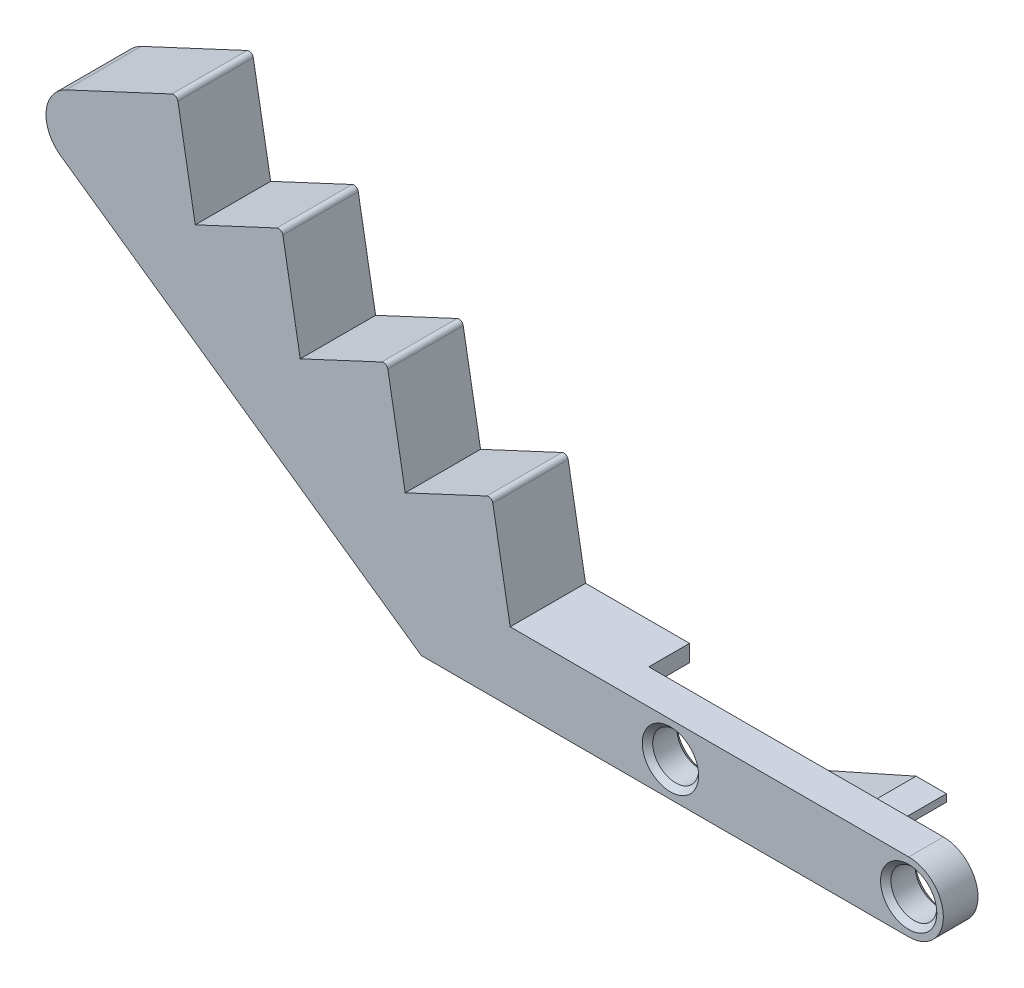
ISO-10303-21;
HEADER;
FILE_DESCRIPTION(('STEP AP214'),'2;1');
FILE_NAME('part.step','',(''),(''),'','','');
FILE_SCHEMA(('AUTOMOTIVE_DESIGN { 1 0 10303 214 1 1 1 1 }'));
ENDSEC;
DATA;
#1=APPLICATION_CONTEXT('core data for automotive mechanical design processes');
#2=APPLICATION_PROTOCOL_DEFINITION('international standard','automotive_design',2000,#1);
#3=PRODUCT_CONTEXT('',#1,'mechanical');
#4=PRODUCT('Part','Part','',(#3));
#5=PRODUCT_RELATED_PRODUCT_CATEGORY('part','',(#4));
#6=PRODUCT_DEFINITION_FORMATION('','',#4);
#7=PRODUCT_DEFINITION_CONTEXT('part definition',#1,'design');
#8=PRODUCT_DEFINITION('design','',#6,#7);
#9=PRODUCT_DEFINITION_SHAPE('','',#8);
#10=(LENGTH_UNIT() NAMED_UNIT(*) SI_UNIT(.MILLI.,.METRE.));
#11=(NAMED_UNIT(*) PLANE_ANGLE_UNIT() SI_UNIT($,.RADIAN.));
#12=(NAMED_UNIT(*) SI_UNIT($,.STERADIAN.) SOLID_ANGLE_UNIT());
#13=UNCERTAINTY_MEASURE_WITH_UNIT(LENGTH_MEASURE(1.E-05),#10,'distance_accuracy_value','');
#14=(GEOMETRIC_REPRESENTATION_CONTEXT(3) GLOBAL_UNCERTAINTY_ASSIGNED_CONTEXT((#13)) GLOBAL_UNIT_ASSIGNED_CONTEXT((#10,
#11,#12)) REPRESENTATION_CONTEXT('',''));
#15=CARTESIAN_POINT('',(0.,0.,0.));
#16=DIRECTION('',(0.,0.,1.));
#17=DIRECTION('',(1.,0.,0.));
#18=AXIS2_PLACEMENT_3D('',#15,#16,#17);
#19=CARTESIAN_POINT('',(-27.5,0.,0.));
#20=DIRECTION('',(0.,0.,1.));
#21=DIRECTION('',(1.,0.,0.));
#22=AXIS2_PLACEMENT_3D('',#19,#20,#21);
#23=PLANE('',#22);
#24=CARTESIAN_POINT('',(0.,0.,0.));
#25=DIRECTION('',(0.,0.,1.));
#26=DIRECTION('',(1.,0.,0.));
#27=AXIS2_PLACEMENT_3D('',#24,#25,#26);
#28=CIRCLE('',#27,3.25);
#29=CARTESIAN_POINT('',(3.25,0.,0.));
#30=VERTEX_POINT('',#29);
#31=EDGE_CURVE('E435',#30,#30,#28,.T.);
#32=ORIENTED_EDGE('',*,*,#31,.T.);
#33=EDGE_LOOP('',(#32));
#34=FACE_BOUND('',#33,.T.);
#35=CARTESIAN_POINT('',(27.5,0.,0.));
#36=DIRECTION('',(0.,0.,1.));
#37=DIRECTION('',(1.,0.,0.));
#38=AXIS2_PLACEMENT_3D('',#35,#36,#37);
#39=CIRCLE('',#38,3.24999999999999);
#40=CARTESIAN_POINT('',(30.75,0.,0.));
#41=VERTEX_POINT('',#40);
#42=EDGE_CURVE('E447',#41,#41,#39,.T.);
#43=ORIENTED_EDGE('',*,*,#42,.T.);
#44=EDGE_LOOP('',(#43));
#45=FACE_BOUND('',#44,.T.);
#46=DIRECTION('',(-1.,0.,0.));
#47=VECTOR('',#46,1.);
#48=CARTESIAN_POINT('',(8.,-3.8,0.));
#49=LINE('',#48,#47);
#50=CARTESIAN_POINT('',(8.,-3.8,0.));
#51=VERTEX_POINT('',#50);
#52=CARTESIAN_POINT('',(6.5,-3.8,0.));
#53=VERTEX_POINT('',#52);
#54=EDGE_CURVE('E392',#51,#53,#49,.T.);
#55=ORIENTED_EDGE('',*,*,#54,.F.);
#56=DIRECTION('',(-0.913545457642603,-0.406736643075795,0.));
#57=VECTOR('',#56,1.);
#58=CARTESIAN_POINT('',(23.160974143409,2.95010058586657,0.));
#59=LINE('',#58,#57);
#60=CARTESIAN_POINT('',(23.1609741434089,2.95010058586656,0.));
#61=VERTEX_POINT('',#60);
#62=EDGE_CURVE('E390',#61,#51,#59,.T.);
#63=ORIENTED_EDGE('',*,*,#62,.F.);
#64=DIRECTION('',(0.,-1.,0.));
#65=VECTOR('',#64,1.);
#66=CARTESIAN_POINT('',(23.160974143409,3.80000000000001,0.));
#67=LINE('',#66,#65);
#68=CARTESIAN_POINT('',(23.1609741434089,3.80000000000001,0.));
#69=VERTEX_POINT('',#68);
#70=EDGE_CURVE('E69',#69,#61,#67,.T.);
#71=ORIENTED_EDGE('',*,*,#70,.F.);
#72=DIRECTION('',(1.,0.,0.));
#73=VECTOR('',#72,1.);
#74=CARTESIAN_POINT('',(19.660974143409,3.80000000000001,0.));
#75=LINE('',#74,#73);
#76=CARTESIAN_POINT('',(19.660974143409,3.80000000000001,0.));
#77=VERTEX_POINT('',#76);
#78=EDGE_CURVE('E371',#77,#69,#75,.T.);
#79=ORIENTED_EDGE('',*,*,#78,.F.);
#80=DIRECTION('',(0.913545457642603,0.406736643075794,0.));
#81=VECTOR('',#80,1.);
#82=CARTESIAN_POINT('',(6.5,-2.0596432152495,0.));
#83=LINE('',#82,#81);
#84=CARTESIAN_POINT('',(6.5,-2.0596432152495,0.));
#85=VERTEX_POINT('',#84);
#86=EDGE_CURVE('E376',#85,#77,#83,.T.);
#87=ORIENTED_EDGE('',*,*,#86,.F.);
#88=DIRECTION('',(0.,1.,0.));
#89=VECTOR('',#88,1.);
#90=CARTESIAN_POINT('',(6.5,-3.8,0.));
#91=LINE('',#90,#89);
#92=EDGE_CURVE('E395',#53,#85,#91,.T.);
#93=ORIENTED_EDGE('',*,*,#92,.F.);
#94=EDGE_LOOP('',(#55,#63,#71,#79,#87,#93));
#95=FACE_BOUND('',#94,.T.);
#96=DIRECTION('',(0.,-1.,0.));
#97=VECTOR('',#96,1.);
#98=CARTESIAN_POINT('',(-6.5,3.8,0.));
#99=LINE('',#98,#97);
#100=CARTESIAN_POINT('',(-6.5,4.,0.));
#101=VERTEX_POINT('',#100);
#102=CARTESIAN_POINT('',(-6.5,2.0596432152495,0.));
#103=VERTEX_POINT('',#102);
#104=EDGE_CURVE('E286',#101,#103,#99,.T.);
#105=ORIENTED_EDGE('',*,*,#104,.F.);
#106=DIRECTION('',(-1.,0.,0.));
#107=VECTOR('',#106,1.);
#108=CARTESIAN_POINT('',(-27.5,4.,0.));
#109=LINE('',#108,#107);
#110=CARTESIAN_POINT('',(27.5,4.00000000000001,0.));
#111=VERTEX_POINT('',#110);
#112=EDGE_CURVE('E419',#111,#101,#109,.T.);
#113=ORIENTED_EDGE('',*,*,#112,.F.);
#114=CARTESIAN_POINT('',(27.5,0.,0.));
#115=DIRECTION('',(0.,0.,1.));
#116=DIRECTION('',(1.,0.,0.));
#117=AXIS2_PLACEMENT_3D('',#114,#115,#116);
#118=CIRCLE('',#117,4.00000000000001);
#119=CARTESIAN_POINT('',(27.5,-4.00000000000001,0.));
#120=VERTEX_POINT('',#119);
#121=EDGE_CURVE('E426',#120,#111,#118,.T.);
#122=ORIENTED_EDGE('',*,*,#121,.F.);
#123=DIRECTION('',(1.,0.,0.));
#124=VECTOR('',#123,1.);
#125=CARTESIAN_POINT('',(-27.5,-4.,0.));
#126=LINE('',#125,#124);
#127=CARTESIAN_POINT('',(-20.1101814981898,-4.,0.));
#128=VERTEX_POINT('',#127);
#129=EDGE_CURVE('E415',#128,#120,#126,.T.);
#130=ORIENTED_EDGE('',*,*,#129,.F.);
#131=DIRECTION('',(-0.913545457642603,-0.406736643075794,0.));
#132=VECTOR('',#131,1.);
#133=CARTESIAN_POINT('',(-6.5,2.0596432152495,0.));
#134=LINE('',#133,#132);
#135=EDGE_CURVE('E61',#103,#128,#134,.T.);
#136=ORIENTED_EDGE('',*,*,#135,.F.);
#137=EDGE_LOOP('',(#105,#113,#122,#130,#136));
#138=FACE_BOUND('',#137,.T.);
#139=ADVANCED_FACE('F45',(#34,#45,#95,#138),#23,.F.);
#140=CARTESIAN_POINT('',(-27.5,4.,4.));
#141=DIRECTION('',(0.,-1.,0.));
#142=DIRECTION('',(1.,0.,0.));
#143=AXIS2_PLACEMENT_3D('',#140,#141,#142);
#144=PLANE('',#143);
#145=ORIENTED_EDGE('',*,*,#112,.T.);
#146=DIRECTION('',(0.,0.,1.));
#147=VECTOR('',#146,1.);
#148=CARTESIAN_POINT('',(-6.5,4.,-82.4586234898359));
#149=LINE('',#148,#147);
#150=CARTESIAN_POINT('',(-6.5,4.,-4.7));
#151=VERTEX_POINT('',#150);
#152=EDGE_CURVE('E346',#151,#101,#149,.T.);
#153=ORIENTED_EDGE('',*,*,#152,.F.);
#154=DIRECTION('',(1.,0.,0.));
#155=VECTOR('',#154,1.);
#156=CARTESIAN_POINT('',(-6.5,4.,-4.7));
#157=LINE('',#156,#155);
#158=CARTESIAN_POINT('',(-18.5,4.00000000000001,-4.7));
#159=VERTEX_POINT('',#158);
#160=EDGE_CURVE('E296',#159,#151,#157,.T.);
#161=ORIENTED_EDGE('',*,*,#160,.F.);
#162=DIRECTION('',(0.,0.,1.));
#163=VECTOR('',#162,1.);
#164=CARTESIAN_POINT('',(-18.5,4.00000000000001,-82.4586234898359));
#165=LINE('',#164,#163);
#166=CARTESIAN_POINT('',(-18.5,4.00000000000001,4.));
#167=VERTEX_POINT('',#166);
#168=EDGE_CURVE('E344',#159,#167,#165,.T.);
#169=ORIENTED_EDGE('',*,*,#168,.T.);
#170=DIRECTION('',(-1.,0.,0.));
#171=VECTOR('',#170,1.);
#172=CARTESIAN_POINT('',(-27.5,4.,4.));
#173=LINE('',#172,#171);
#174=CARTESIAN_POINT('',(27.5,4.00000000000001,4.));
#175=VERTEX_POINT('',#174);
#176=EDGE_CURVE('E421',#175,#167,#173,.T.);
#177=ORIENTED_EDGE('',*,*,#176,.F.);
#178=DIRECTION('',(0.,0.,-1.));
#179=VECTOR('',#178,1.);
#180=CARTESIAN_POINT('',(27.5,4.00000000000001,4.));
#181=LINE('',#180,#179);
#182=EDGE_CURVE('E424',#175,#111,#181,.T.);
#183=ORIENTED_EDGE('',*,*,#182,.T.);
#184=EDGE_LOOP('',(#145,#153,#161,#169,#177,#183));
#185=FACE_BOUND('',#184,.T.);
#186=ADVANCED_FACE('F474',(#185),#144,.F.);
#187=CARTESIAN_POINT('',(-27.5,-4.,4.));
#188=DIRECTION('',(0.,1.,0.));
#189=DIRECTION('',(0.,0.,1.));
#190=AXIS2_PLACEMENT_3D('',#187,#188,#189);
#191=PLANE('',#190);
#192=DIRECTION('',(0.,0.,1.));
#193=VECTOR('',#192,1.);
#194=CARTESIAN_POINT('',(-20.1101814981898,-4.,-82.4586234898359));
#195=LINE('',#194,#193);
#196=CARTESIAN_POINT('',(-20.1101814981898,-4.,-4.7));
#197=VERTEX_POINT('',#196);
#198=EDGE_CURVE('E349',#197,#128,#195,.T.);
#199=ORIENTED_EDGE('',*,*,#198,.T.);
#200=ORIENTED_EDGE('',*,*,#129,.T.);
#201=DIRECTION('',(0.,0.,-1.));
#202=VECTOR('',#201,1.);
#203=CARTESIAN_POINT('',(27.5,-4.00000000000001,4.));
#204=LINE('',#203,#202);
#205=CARTESIAN_POINT('',(27.5,-4.00000000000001,4.));
#206=VERTEX_POINT('',#205);
#207=EDGE_CURVE('E432',#206,#120,#204,.T.);
#208=ORIENTED_EDGE('',*,*,#207,.F.);
#209=DIRECTION('',(1.,0.,0.));
#210=VECTOR('',#209,1.);
#211=CARTESIAN_POINT('',(-27.5,-4.,4.));
#212=LINE('',#211,#210);
#213=CARTESIAN_POINT('',(-28.7611951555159,-4.,4.));
#214=VERTEX_POINT('',#213);
#215=EDGE_CURVE('E416',#214,#206,#212,.T.);
#216=ORIENTED_EDGE('',*,*,#215,.F.);
#217=DIRECTION('',(0.,0.,1.));
#218=VECTOR('',#217,1.);
#219=CARTESIAN_POINT('',(-28.7611951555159,-4.,-82.4586234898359));
#220=LINE('',#219,#218);
#221=CARTESIAN_POINT('',(-28.7611951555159,-4.,-4.7));
#222=VERTEX_POINT('',#221);
#223=EDGE_CURVE('E352',#222,#214,#220,.T.);
#224=ORIENTED_EDGE('',*,*,#223,.F.);
#225=DIRECTION('',(-1.,0.,0.));
#226=VECTOR('',#225,1.);
#227=CARTESIAN_POINT('',(-20.1101814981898,-4.,-4.7));
#228=LINE('',#227,#226);
#229=EDGE_CURVE('E293',#197,#222,#228,.T.);
#230=ORIENTED_EDGE('',*,*,#229,.F.);
#231=EDGE_LOOP('',(#199,#200,#208,#216,#224,#230));
#232=FACE_BOUND('',#231,.T.);
#233=ADVANCED_FACE('F481',(#232),#191,.F.);
#234=CARTESIAN_POINT('',(27.5,0.,4.));
#235=DIRECTION('',(0.,0.,-1.));
#236=DIRECTION('',(-1.,0.,0.));
#237=AXIS2_PLACEMENT_3D('',#234,#235,#236);
#238=CYLINDRICAL_SURFACE('',#237,4.00000000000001);
#239=ORIENTED_EDGE('',*,*,#121,.T.);
#240=ORIENTED_EDGE('',*,*,#182,.F.);
#241=CARTESIAN_POINT('',(27.5,0.,4.));
#242=DIRECTION('',(0.,0.,1.));
#243=DIRECTION('',(1.,0.,0.));
#244=AXIS2_PLACEMENT_3D('',#241,#242,#243);
#245=CIRCLE('',#244,4.00000000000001);
#246=EDGE_CURVE('E418',#206,#175,#245,.T.);
#247=ORIENTED_EDGE('',*,*,#246,.F.);
#248=ORIENTED_EDGE('',*,*,#207,.T.);
#249=EDGE_LOOP('',(#239,#240,#247,#248));
#250=FACE_BOUND('',#249,.T.);
#251=ADVANCED_FACE('F488',(#250),#238,.T.);
#252=CARTESIAN_POINT('',(-27.5,0.,4.));
#253=DIRECTION('',(0.,0.,1.));
#254=DIRECTION('',(1.,0.,0.));
#255=AXIS2_PLACEMENT_3D('',#252,#253,#254);
#256=PLANE('',#255);
#257=CARTESIAN_POINT('',(-68.0793301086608,28.4139528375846,4.));
#258=DIRECTION('',(0.,0.,1.));
#259=DIRECTION('',(1.,0.,0.));
#260=AXIS2_PLACEMENT_3D('',#257,#258,#259);
#261=CIRCLE('',#260,4.);
#262=CARTESIAN_POINT('',(-70.3736358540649,25.1373446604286,4.));
#263=VERTEX_POINT('',#262);
#264=CARTESIAN_POINT('',(-69.7698031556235,32.0391839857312,4.));
#265=VERTEX_POINT('',#264);
#266=EDGE_CURVE('E259',#263,#265,#261,.F.);
#267=ORIENTED_EDGE('',*,*,#266,.F.);
#268=DIRECTION('',(-0.819152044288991,0.573576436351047,0.));
#269=VECTOR('',#268,1.);
#270=CARTESIAN_POINT('',(-28.7611951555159,-4.,4.));
#271=LINE('',#270,#269);
#272=EDGE_CURVE('E262',#214,#263,#271,.T.);
#273=ORIENTED_EDGE('',*,*,#272,.F.);
#274=ORIENTED_EDGE('',*,*,#215,.T.);
#275=ORIENTED_EDGE('',*,*,#246,.T.);
#276=ORIENTED_EDGE('',*,*,#176,.T.);
#277=DIRECTION('',(0.173648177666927,-0.984807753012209,0.));
#278=VECTOR('',#277,1.);
#279=CARTESIAN_POINT('',(-18.5,4.00000000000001,4.));
#280=LINE('',#279,#278);
#281=CARTESIAN_POINT('',(-20.5027724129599,15.3582867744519,4.));
#282=VERTEX_POINT('',#281);
#283=EDGE_CURVE('E264',#282,#167,#280,.T.);
#284=ORIENTED_EDGE('',*,*,#283,.F.);
#285=CARTESIAN_POINT('',(-20.995176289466,15.2714626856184,4.));
#286=DIRECTION('',(0.,0.,1.));
#287=DIRECTION('',(1.,0.,0.));
#288=AXIS2_PLACEMENT_3D('',#285,#286,#287);
#289=CIRCLE('',#288,0.499999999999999);
#290=CARTESIAN_POINT('',(-21.2064854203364,15.7246165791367,4.));
#291=VERTEX_POINT('',#290);
#292=EDGE_CURVE('E267',#291,#282,#289,.F.);
#293=ORIENTED_EDGE('',*,*,#292,.F.);
#294=DIRECTION('',(0.90630778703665,0.4226182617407,0.));
#295=VECTOR('',#294,1.);
#296=CARTESIAN_POINT('',(-21.2064854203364,15.7246165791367,4.));
#297=LINE('',#296,#295);
#298=CARTESIAN_POINT('',(-30.6159237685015,11.33692341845,4.));
#299=VERTEX_POINT('',#298);
#300=EDGE_CURVE('E270',#299,#291,#297,.T.);
#301=ORIENTED_EDGE('',*,*,#300,.F.);
#302=DIRECTION('',(0.173648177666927,-0.984807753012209,0.));
#303=VECTOR('',#302,1.);
#304=CARTESIAN_POINT('',(-30.6159237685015,11.33692341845,4.));
#305=LINE('',#304,#303);
#306=CARTESIAN_POINT('',(-32.6186961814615,22.6952101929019,4.));
#307=VERTEX_POINT('',#306);
#308=EDGE_CURVE('E273',#307,#299,#305,.T.);
#309=ORIENTED_EDGE('',*,*,#308,.F.);
#310=CARTESIAN_POINT('',(-33.1111000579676,22.6083861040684,4.));
#311=DIRECTION('',(0.,0.,1.));
#312=DIRECTION('',(1.,0.,0.));
#313=AXIS2_PLACEMENT_3D('',#310,#311,#312);
#314=CIRCLE('',#313,0.499999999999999);
#315=CARTESIAN_POINT('',(-33.3224091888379,23.0615399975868,4.));
#316=VERTEX_POINT('',#315);
#317=EDGE_CURVE('E276',#316,#307,#314,.F.);
#318=ORIENTED_EDGE('',*,*,#317,.F.);
#319=DIRECTION('',(0.90630778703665,0.422618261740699,0.));
#320=VECTOR('',#319,1.);
#321=CARTESIAN_POINT('',(-33.3224091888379,23.0615399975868,4.));
#322=LINE('',#321,#320);
#323=CARTESIAN_POINT('',(-42.7318475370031,18.6738468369,4.));
#324=VERTEX_POINT('',#323);
#325=EDGE_CURVE('E279',#324,#316,#322,.T.);
#326=ORIENTED_EDGE('',*,*,#325,.F.);
#327=DIRECTION('',(0.173648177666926,-0.984807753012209,0.));
#328=VECTOR('',#327,1.);
#329=CARTESIAN_POINT('',(-42.7318475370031,18.6738468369,4.));
#330=LINE('',#329,#328);
#331=CARTESIAN_POINT('',(-44.734619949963,30.0321336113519,4.));
#332=VERTEX_POINT('',#331);
#333=EDGE_CURVE('E244',#332,#324,#330,.T.);
#334=ORIENTED_EDGE('',*,*,#333,.F.);
#335=CARTESIAN_POINT('',(-45.2270238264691,29.9453095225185,4.));
#336=DIRECTION('',(0.,0.,1.));
#337=DIRECTION('',(1.,0.,0.));
#338=AXIS2_PLACEMENT_3D('',#335,#336,#337);
#339=CIRCLE('',#338,0.499999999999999);
#340=CARTESIAN_POINT('',(-45.4383329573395,30.3984634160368,4.));
#341=VERTEX_POINT('',#340);
#342=EDGE_CURVE('E224',#341,#332,#339,.F.);
#343=ORIENTED_EDGE('',*,*,#342,.F.);
#344=DIRECTION('',(0.90630778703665,0.4226182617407,0.));
#345=VECTOR('',#344,1.);
#346=CARTESIAN_POINT('',(-45.4383329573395,30.3984634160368,4.));
#347=LINE('',#346,#345);
#348=CARTESIAN_POINT('',(-54.8477713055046,26.01077025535,4.));
#349=VERTEX_POINT('',#348);
#350=EDGE_CURVE('E240',#349,#341,#347,.T.);
#351=ORIENTED_EDGE('',*,*,#350,.F.);
#352=DIRECTION('',(0.173648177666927,-0.984807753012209,0.));
#353=VECTOR('',#352,1.);
#354=CARTESIAN_POINT('',(-54.8477713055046,26.01077025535,4.));
#355=LINE('',#354,#353);
#356=CARTESIAN_POINT('',(-56.8505437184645,37.3690570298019,4.));
#357=VERTEX_POINT('',#356);
#358=EDGE_CURVE('E250',#357,#349,#355,.T.);
#359=ORIENTED_EDGE('',*,*,#358,.F.);
#360=CARTESIAN_POINT('',(-57.3429475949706,37.2822329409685,4.));
#361=DIRECTION('',(0.,0.,1.));
#362=DIRECTION('',(1.,0.,0.));
#363=AXIS2_PLACEMENT_3D('',#360,#361,#362);
#364=CIRCLE('',#363,0.500000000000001);
#365=CARTESIAN_POINT('',(-57.554256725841,37.7353868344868,4.));
#366=VERTEX_POINT('',#365);
#367=EDGE_CURVE('E253',#366,#357,#364,.F.);
#368=ORIENTED_EDGE('',*,*,#367,.F.);
#369=DIRECTION('',(0.90630778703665,0.422618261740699,0.));
#370=VECTOR('',#369,1.);
#371=CARTESIAN_POINT('',(-57.554256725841,37.7353868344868,4.));
#372=LINE('',#371,#370);
#373=EDGE_CURVE('E256',#265,#366,#372,.T.);
#374=ORIENTED_EDGE('',*,*,#373,.F.);
#375=EDGE_LOOP('',(#267,#273,#274,#275,#276,#284,#293,#301,#309,#318,#326,#334,#343,#351,#359,
#368,#374));
#376=FACE_BOUND('',#375,.T.);
#377=CARTESIAN_POINT('',(0.,0.,4.));
#378=DIRECTION('',(0.,0.,1.));
#379=DIRECTION('',(1.,0.,0.));
#380=AXIS2_PLACEMENT_3D('',#377,#378,#379);
#381=CIRCLE('',#380,3.24999999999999);
#382=CARTESIAN_POINT('',(3.24999999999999,0.,4.));
#383=VERTEX_POINT('',#382);
#384=EDGE_CURVE('E444',#383,#383,#381,.F.);
#385=ORIENTED_EDGE('',*,*,#384,.T.);
#386=EDGE_LOOP('',(#385));
#387=FACE_BOUND('',#386,.T.);
#388=CARTESIAN_POINT('',(27.5,0.,4.));
#389=DIRECTION('',(0.,0.,1.));
#390=DIRECTION('',(1.,0.,0.));
#391=AXIS2_PLACEMENT_3D('',#388,#389,#390);
#392=CIRCLE('',#391,3.24999999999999);
#393=CARTESIAN_POINT('',(30.75,0.,4.));
#394=VERTEX_POINT('',#393);
#395=EDGE_CURVE('E11',#394,#394,#392,.F.);
#396=ORIENTED_EDGE('',*,*,#395,.T.);
#397=EDGE_LOOP('',(#396));
#398=FACE_BOUND('',#397,.T.);
#399=ADVANCED_FACE('F237',(#376,#387,#398),#256,.T.);
#400=CARTESIAN_POINT('',(27.5,0.,0.));
#401=DIRECTION('',(0.,0.,1.));
#402=DIRECTION('',(1.,0.,0.));
#403=AXIS2_PLACEMENT_3D('',#400,#401,#402);
#404=CYLINDRICAL_SURFACE('',#403,2.65);
#405=CARTESIAN_POINT('',(27.5,0.,3.4));
#406=DIRECTION('',(0.,0.,1.));
#407=DIRECTION('',(1.,0.,0.));
#408=AXIS2_PLACEMENT_3D('',#405,#406,#407);
#409=CIRCLE('',#408,2.65);
#410=CARTESIAN_POINT('',(30.15,0.,3.4));
#411=VERTEX_POINT('',#410);
#412=EDGE_CURVE('E54',#411,#411,#409,.T.);
#413=ORIENTED_EDGE('',*,*,#412,.T.);
#414=EDGE_LOOP('',(#413));
#415=FACE_BOUND('',#414,.T.);
#416=CARTESIAN_POINT('',(27.5,0.,0.599999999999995));
#417=DIRECTION('',(0.,0.,1.));
#418=DIRECTION('',(1.,0.,0.));
#419=AXIS2_PLACEMENT_3D('',#416,#417,#418);
#420=CIRCLE('',#419,2.65);
#421=CARTESIAN_POINT('',(30.15,0.,0.599999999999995));
#422=VERTEX_POINT('',#421);
#423=EDGE_CURVE('E450',#422,#422,#420,.F.);
#424=ORIENTED_EDGE('',*,*,#423,.T.);
#425=EDGE_LOOP('',(#424));
#426=FACE_BOUND('',#425,.T.);
#427=ADVANCED_FACE('F455',(#415,#426),#404,.F.);
#428=CARTESIAN_POINT('',(0.,0.,0.));
#429=DIRECTION('',(0.,0.,1.));
#430=DIRECTION('',(1.,0.,0.));
#431=AXIS2_PLACEMENT_3D('',#428,#429,#430);
#432=CYLINDRICAL_SURFACE('',#431,2.65);
#433=CARTESIAN_POINT('',(0.,0.,3.4));
#434=DIRECTION('',(0.,0.,1.));
#435=DIRECTION('',(1.,0.,0.));
#436=AXIS2_PLACEMENT_3D('',#433,#434,#435);
#437=CIRCLE('',#436,2.65);
#438=CARTESIAN_POINT('',(2.65,0.,3.4));
#439=VERTEX_POINT('',#438);
#440=EDGE_CURVE('E441',#439,#439,#437,.T.);
#441=ORIENTED_EDGE('',*,*,#440,.T.);
#442=EDGE_LOOP('',(#441));
#443=FACE_BOUND('',#442,.T.);
#444=CARTESIAN_POINT('',(0.,0.,0.6));
#445=DIRECTION('',(0.,0.,1.));
#446=DIRECTION('',(1.,0.,0.));
#447=AXIS2_PLACEMENT_3D('',#444,#445,#446);
#448=CIRCLE('',#447,2.65);
#449=CARTESIAN_POINT('',(2.65,0.,0.6));
#450=VERTEX_POINT('',#449);
#451=EDGE_CURVE('E438',#450,#450,#448,.F.);
#452=ORIENTED_EDGE('',*,*,#451,.T.);
#453=EDGE_LOOP('',(#452));
#454=FACE_BOUND('',#453,.T.);
#455=ADVANCED_FACE('F502',(#443,#454),#432,.F.);
#456=CARTESIAN_POINT('',(0.,0.,0.));
#457=DIRECTION('',(0.,0.,-1.));
#458=DIRECTION('',(-1.,0.,0.));
#459=AXIS2_PLACEMENT_3D('',#456,#457,#458);
#460=CONICAL_SURFACE('',#459,3.25,0.785398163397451);
#461=ORIENTED_EDGE('',*,*,#451,.F.);
#462=EDGE_LOOP('',(#461));
#463=FACE_BOUND('',#462,.T.);
#464=ORIENTED_EDGE('',*,*,#31,.F.);
#465=EDGE_LOOP('',(#464));
#466=FACE_BOUND('',#465,.T.);
#467=ADVANCED_FACE('F496',(#463,#466),#460,.F.);
#468=CARTESIAN_POINT('',(0.,0.,3.4));
#469=DIRECTION('',(0.,0.,1.));
#470=DIRECTION('',(1.,0.,0.));
#471=AXIS2_PLACEMENT_3D('',#468,#469,#470);
#472=CONICAL_SURFACE('',#471,2.65,0.785398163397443);
#473=ORIENTED_EDGE('',*,*,#384,.F.);
#474=EDGE_LOOP('',(#473));
#475=FACE_BOUND('',#474,.T.);
#476=ORIENTED_EDGE('',*,*,#440,.F.);
#477=EDGE_LOOP('',(#476));
#478=FACE_BOUND('',#477,.T.);
#479=ADVANCED_FACE('F470',(#475,#478),#472,.F.);
#480=CARTESIAN_POINT('',(27.5,0.,0.));
#481=DIRECTION('',(0.,0.,-1.));
#482=DIRECTION('',(-1.,0.,0.));
#483=AXIS2_PLACEMENT_3D('',#480,#481,#482);
#484=CONICAL_SURFACE('',#483,3.24999999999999,0.785398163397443);
#485=ORIENTED_EDGE('',*,*,#423,.F.);
#486=EDGE_LOOP('',(#485));
#487=FACE_BOUND('',#486,.T.);
#488=ORIENTED_EDGE('',*,*,#42,.F.);
#489=EDGE_LOOP('',(#488));
#490=FACE_BOUND('',#489,.T.);
#491=ADVANCED_FACE('F460',(#487,#490),#484,.F.);
#492=CARTESIAN_POINT('',(27.5,0.,3.4));
#493=DIRECTION('',(0.,0.,1.));
#494=DIRECTION('',(1.,0.,0.));
#495=AXIS2_PLACEMENT_3D('',#492,#493,#494);
#496=CONICAL_SURFACE('',#495,2.65,0.785398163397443);
#497=ORIENTED_EDGE('',*,*,#395,.F.);
#498=EDGE_LOOP('',(#497));
#499=FACE_BOUND('',#498,.T.);
#500=ORIENTED_EDGE('',*,*,#412,.F.);
#501=EDGE_LOOP('',(#500));
#502=FACE_BOUND('',#501,.T.);
#503=ADVANCED_FACE('F48',(#499,#502),#496,.F.);
#504=CARTESIAN_POINT('',(19.660974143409,3.80000000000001,-4.7));
#505=DIRECTION('',(0.,-1.,0.));
#506=DIRECTION('',(1.,0.,0.));
#507=AXIS2_PLACEMENT_3D('',#504,#505,#506);
#508=PLANE('',#507);
#509=ORIENTED_EDGE('',*,*,#78,.T.);
#510=DIRECTION('',(0.,0.,1.));
#511=VECTOR('',#510,1.);
#512=CARTESIAN_POINT('',(23.160974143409,3.80000000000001,-4.7));
#513=LINE('',#512,#511);
#514=CARTESIAN_POINT('',(23.160974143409,3.80000000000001,-4.7));
#515=VERTEX_POINT('',#514);
#516=EDGE_CURVE('E413',#515,#69,#513,.T.);
#517=ORIENTED_EDGE('',*,*,#516,.F.);
#518=DIRECTION('',(1.,0.,0.));
#519=VECTOR('',#518,1.);
#520=CARTESIAN_POINT('',(19.660974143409,3.80000000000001,-4.7));
#521=LINE('',#520,#519);
#522=CARTESIAN_POINT('',(19.660974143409,3.80000000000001,-4.7));
#523=VERTEX_POINT('',#522);
#524=EDGE_CURVE('E372',#523,#515,#521,.T.);
#525=ORIENTED_EDGE('',*,*,#524,.F.);
#526=DIRECTION('',(0.,0.,1.));
#527=VECTOR('',#526,1.);
#528=CARTESIAN_POINT('',(19.660974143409,3.80000000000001,-4.7));
#529=LINE('',#528,#527);
#530=EDGE_CURVE('E386',#523,#77,#529,.T.);
#531=ORIENTED_EDGE('',*,*,#530,.T.);
#532=EDGE_LOOP('',(#509,#517,#525,#531));
#533=FACE_BOUND('',#532,.T.);
#534=ADVANCED_FACE('F459',(#533),#508,.F.);
#535=CARTESIAN_POINT('',(23.160974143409,3.80000000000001,-4.7));
#536=DIRECTION('',(-1.,0.,0.));
#537=DIRECTION('',(0.,0.,1.));
#538=AXIS2_PLACEMENT_3D('',#535,#536,#537);
#539=PLANE('',#538);
#540=ORIENTED_EDGE('',*,*,#70,.T.);
#541=DIRECTION('',(0.,0.,1.));
#542=VECTOR('',#541,1.);
#543=CARTESIAN_POINT('',(23.160974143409,2.95010058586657,-4.7));
#544=LINE('',#543,#542);
#545=CARTESIAN_POINT('',(23.160974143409,2.95010058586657,-4.7));
#546=VERTEX_POINT('',#545);
#547=EDGE_CURVE('E410',#546,#61,#544,.T.);
#548=ORIENTED_EDGE('',*,*,#547,.F.);
#549=DIRECTION('',(0.,-1.,0.));
#550=VECTOR('',#549,1.);
#551=CARTESIAN_POINT('',(23.160974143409,3.80000000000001,-4.7));
#552=LINE('',#551,#550);
#553=EDGE_CURVE('E375',#515,#546,#552,.T.);
#554=ORIENTED_EDGE('',*,*,#553,.F.);
#555=ORIENTED_EDGE('',*,*,#516,.T.);
#556=EDGE_LOOP('',(#540,#548,#554,#555));
#557=FACE_BOUND('',#556,.T.);
#558=ADVANCED_FACE('F466',(#557),#539,.F.);
#559=CARTESIAN_POINT('',(23.160974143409,2.95010058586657,-4.7));
#560=DIRECTION('',(-0.406736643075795,0.913545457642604,0.));
#561=DIRECTION('',(-0.913545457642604,-0.406736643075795,0.));
#562=AXIS2_PLACEMENT_3D('',#559,#560,#561);
#563=PLANE('',#562);
#564=ORIENTED_EDGE('',*,*,#62,.T.);
#565=DIRECTION('',(0.,0.,1.));
#566=VECTOR('',#565,1.);
#567=CARTESIAN_POINT('',(8.,-3.8,-4.7));
#568=LINE('',#567,#566);
#569=CARTESIAN_POINT('',(8.,-3.8,-4.7));
#570=VERTEX_POINT('',#569);
#571=EDGE_CURVE('E407',#570,#51,#568,.T.);
#572=ORIENTED_EDGE('',*,*,#571,.F.);
#573=DIRECTION('',(-0.913545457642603,-0.406736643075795,0.));
#574=VECTOR('',#573,1.);
#575=CARTESIAN_POINT('',(23.160974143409,2.95010058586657,-4.7));
#576=LINE('',#575,#574);
#577=EDGE_CURVE('E378',#546,#570,#576,.T.);
#578=ORIENTED_EDGE('',*,*,#577,.F.);
#579=ORIENTED_EDGE('',*,*,#547,.T.);
#580=EDGE_LOOP('',(#564,#572,#578,#579));
#581=FACE_BOUND('',#580,.T.);
#582=ADVANCED_FACE('F530',(#581),#563,.F.);
#583=CARTESIAN_POINT('',(8.,-3.8,-4.7));
#584=DIRECTION('',(0.,1.,0.));
#585=DIRECTION('',(0.,0.,1.));
#586=AXIS2_PLACEMENT_3D('',#583,#584,#585);
#587=PLANE('',#586);
#588=ORIENTED_EDGE('',*,*,#54,.T.);
#589=DIRECTION('',(0.,0.,1.));
#590=VECTOR('',#589,1.);
#591=CARTESIAN_POINT('',(6.5,-3.8,-4.7));
#592=LINE('',#591,#590);
#593=CARTESIAN_POINT('',(6.5,-3.8,-4.7));
#594=VERTEX_POINT('',#593);
#595=EDGE_CURVE('E404',#594,#53,#592,.T.);
#596=ORIENTED_EDGE('',*,*,#595,.F.);
#597=DIRECTION('',(-1.,0.,0.));
#598=VECTOR('',#597,1.);
#599=CARTESIAN_POINT('',(8.,-3.8,-4.7));
#600=LINE('',#599,#598);
#601=EDGE_CURVE('E380',#570,#594,#600,.T.);
#602=ORIENTED_EDGE('',*,*,#601,.F.);
#603=ORIENTED_EDGE('',*,*,#571,.T.);
#604=EDGE_LOOP('',(#588,#596,#602,#603));
#605=FACE_BOUND('',#604,.T.);
#606=ADVANCED_FACE('F534',(#605),#587,.F.);
#607=CARTESIAN_POINT('',(6.5,-3.8,-4.7));
#608=DIRECTION('',(1.,0.,0.));
#609=DIRECTION('',(0.,0.,-1.));
#610=AXIS2_PLACEMENT_3D('',#607,#608,#609);
#611=PLANE('',#610);
#612=ORIENTED_EDGE('',*,*,#92,.T.);
#613=DIRECTION('',(0.,0.,1.));
#614=VECTOR('',#613,1.);
#615=CARTESIAN_POINT('',(6.5,-2.0596432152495,-4.7));
#616=LINE('',#615,#614);
#617=CARTESIAN_POINT('',(6.5,-2.0596432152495,-4.7));
#618=VERTEX_POINT('',#617);
#619=EDGE_CURVE('E401',#618,#85,#616,.T.);
#620=ORIENTED_EDGE('',*,*,#619,.F.);
#621=DIRECTION('',(0.,1.,0.));
#622=VECTOR('',#621,1.);
#623=CARTESIAN_POINT('',(6.5,-3.8,-4.7));
#624=LINE('',#623,#622);
#625=EDGE_CURVE('E382',#594,#618,#624,.T.);
#626=ORIENTED_EDGE('',*,*,#625,.F.);
#627=ORIENTED_EDGE('',*,*,#595,.T.);
#628=EDGE_LOOP('',(#612,#620,#626,#627));
#629=FACE_BOUND('',#628,.T.);
#630=ADVANCED_FACE('F538',(#629),#611,.F.);
#631=CARTESIAN_POINT('',(6.5,-2.0596432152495,-4.7));
#632=DIRECTION('',(0.406736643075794,-0.913545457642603,0.));
#633=DIRECTION('',(0.913545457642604,0.406736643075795,0.));
#634=AXIS2_PLACEMENT_3D('',#631,#632,#633);
#635=PLANE('',#634);
#636=ORIENTED_EDGE('',*,*,#530,.F.);
#637=DIRECTION('',(0.913545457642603,0.406736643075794,0.));
#638=VECTOR('',#637,1.);
#639=CARTESIAN_POINT('',(6.5,-2.0596432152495,-4.7));
#640=LINE('',#639,#638);
#641=EDGE_CURVE('E384',#618,#523,#640,.T.);
#642=ORIENTED_EDGE('',*,*,#641,.F.);
#643=ORIENTED_EDGE('',*,*,#619,.T.);
#644=ORIENTED_EDGE('',*,*,#86,.T.);
#645=EDGE_LOOP('',(#636,#642,#643,#644));
#646=FACE_BOUND('',#645,.T.);
#647=ADVANCED_FACE('F542',(#646),#635,.F.);
#648=CARTESIAN_POINT('',(0.,0.,-4.7));
#649=DIRECTION('',(0.,0.,-1.));
#650=DIRECTION('',(-1.,0.,0.));
#651=AXIS2_PLACEMENT_3D('',#648,#649,#650);
#652=PLANE('',#651);
#653=ORIENTED_EDGE('',*,*,#577,.T.);
#654=ORIENTED_EDGE('',*,*,#601,.T.);
#655=ORIENTED_EDGE('',*,*,#625,.T.);
#656=ORIENTED_EDGE('',*,*,#641,.T.);
#657=ORIENTED_EDGE('',*,*,#524,.T.);
#658=ORIENTED_EDGE('',*,*,#553,.T.);
#659=EDGE_LOOP('',(#653,#654,#655,#656,#657,#658));
#660=FACE_BOUND('',#659,.T.);
#661=ADVANCED_FACE('F546',(#660),#652,.T.);
#662=CARTESIAN_POINT('',(0.,0.,-4.7));
#663=DIRECTION('',(0.,0.,-1.));
#664=DIRECTION('',(1.,0.,0.));
#665=AXIS2_PLACEMENT_3D('',#662,#663,#664);
#666=PLANE('',#665);
#667=DIRECTION('',(-0.913545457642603,-0.406736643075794,0.));
#668=VECTOR('',#667,1.);
#669=CARTESIAN_POINT('',(-6.5,2.0596432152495,-4.7));
#670=LINE('',#669,#668);
#671=CARTESIAN_POINT('',(-6.5,2.0596432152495,-4.7));
#672=VERTEX_POINT('',#671);
#673=EDGE_CURVE('E364',#672,#197,#670,.T.);
#674=ORIENTED_EDGE('',*,*,#673,.T.);
#675=ORIENTED_EDGE('',*,*,#229,.T.);
#676=DIRECTION('',(-0.819152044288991,0.573576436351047,0.));
#677=VECTOR('',#676,1.);
#678=CARTESIAN_POINT('',(-28.7611951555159,-4.,-4.7));
#679=LINE('',#678,#677);
#680=CARTESIAN_POINT('',(-70.3736358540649,25.1373446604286,-4.7));
#681=VERTEX_POINT('',#680);
#682=EDGE_CURVE('E290',#222,#681,#679,.T.);
#683=ORIENTED_EDGE('',*,*,#682,.T.);
#684=CARTESIAN_POINT('',(-68.0793301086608,28.4139528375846,-4.7));
#685=DIRECTION('',(0.,0.,-1.));
#686=DIRECTION('',(-1.,0.,0.));
#687=AXIS2_PLACEMENT_3D('',#684,#685,#686);
#688=CIRCLE('',#687,4.);
#689=CARTESIAN_POINT('',(-69.7698031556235,32.0391839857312,-4.7));
#690=VERTEX_POINT('',#689);
#691=EDGE_CURVE('E287',#681,#690,#688,.T.);
#692=ORIENTED_EDGE('',*,*,#691,.T.);
#693=DIRECTION('',(0.90630778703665,0.4226182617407,0.));
#694=VECTOR('',#693,1.);
#695=CARTESIAN_POINT('',(-57.554256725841,37.7353868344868,-4.7));
#696=LINE('',#695,#694);
#697=CARTESIAN_POINT('',(-57.554256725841,37.7353868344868,-4.7));
#698=VERTEX_POINT('',#697);
#699=EDGE_CURVE('E283',#690,#698,#696,.T.);
#700=ORIENTED_EDGE('',*,*,#699,.T.);
#701=CARTESIAN_POINT('',(-57.3429475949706,37.2822329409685,-4.7));
#702=DIRECTION('',(0.,0.,-1.));
#703=DIRECTION('',(-1.,0.,0.));
#704=AXIS2_PLACEMENT_3D('',#701,#702,#703);
#705=CIRCLE('',#704,0.500000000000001);
#706=CARTESIAN_POINT('',(-56.8505437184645,37.3690570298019,-4.7));
#707=VERTEX_POINT('',#706);
#708=EDGE_CURVE('E326',#698,#707,#705,.T.);
#709=ORIENTED_EDGE('',*,*,#708,.T.);
#710=DIRECTION('',(0.173648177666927,-0.984807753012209,0.));
#711=VECTOR('',#710,1.);
#712=CARTESIAN_POINT('',(-54.8477713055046,26.01077025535,-4.7));
#713=LINE('',#712,#711);
#714=CARTESIAN_POINT('',(-54.8477713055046,26.01077025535,-4.7));
#715=VERTEX_POINT('',#714);
#716=EDGE_CURVE('E323',#707,#715,#713,.T.);
#717=ORIENTED_EDGE('',*,*,#716,.T.);
#718=DIRECTION('',(0.90630778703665,0.4226182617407,0.));
#719=VECTOR('',#718,1.);
#720=CARTESIAN_POINT('',(-45.4383329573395,30.3984634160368,-4.7));
#721=LINE('',#720,#719);
#722=CARTESIAN_POINT('',(-45.4383329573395,30.3984634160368,-4.7));
#723=VERTEX_POINT('',#722);
#724=EDGE_CURVE('E321',#715,#723,#721,.T.);
#725=ORIENTED_EDGE('',*,*,#724,.T.);
#726=CARTESIAN_POINT('',(-45.2270238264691,29.9453095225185,-4.7));
#727=DIRECTION('',(0.,0.,-1.));
#728=DIRECTION('',(-1.,0.,0.));
#729=AXIS2_PLACEMENT_3D('',#726,#727,#728);
#730=CIRCLE('',#729,0.499999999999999);
#731=CARTESIAN_POINT('',(-44.734619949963,30.0321336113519,-4.7));
#732=VERTEX_POINT('',#731);
#733=EDGE_CURVE('E226',#723,#732,#730,.T.);
#734=ORIENTED_EDGE('',*,*,#733,.T.);
#735=DIRECTION('',(0.173648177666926,-0.984807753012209,0.));
#736=VECTOR('',#735,1.);
#737=CARTESIAN_POINT('',(-42.7318475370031,18.6738468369,-4.7));
#738=LINE('',#737,#736);
#739=CARTESIAN_POINT('',(-42.7318475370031,18.6738468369,-4.7));
#740=VERTEX_POINT('',#739);
#741=EDGE_CURVE('E317',#732,#740,#738,.T.);
#742=ORIENTED_EDGE('',*,*,#741,.T.);
#743=DIRECTION('',(0.90630778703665,0.422618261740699,0.));
#744=VECTOR('',#743,1.);
#745=CARTESIAN_POINT('',(-33.3224091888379,23.0615399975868,-4.7));
#746=LINE('',#745,#744);
#747=CARTESIAN_POINT('',(-33.3224091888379,23.0615399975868,-4.7));
#748=VERTEX_POINT('',#747);
#749=EDGE_CURVE('E314',#740,#748,#746,.T.);
#750=ORIENTED_EDGE('',*,*,#749,.T.);
#751=CARTESIAN_POINT('',(-33.1111000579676,22.6083861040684,-4.7));
#752=DIRECTION('',(0.,0.,-1.));
#753=DIRECTION('',(-1.,0.,0.));
#754=AXIS2_PLACEMENT_3D('',#751,#752,#753);
#755=CIRCLE('',#754,0.499999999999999);
#756=CARTESIAN_POINT('',(-32.6186961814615,22.6952101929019,-4.7));
#757=VERTEX_POINT('',#756);
#758=EDGE_CURVE('E311',#748,#757,#755,.T.);
#759=ORIENTED_EDGE('',*,*,#758,.T.);
#760=DIRECTION('',(0.173648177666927,-0.984807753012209,0.));
#761=VECTOR('',#760,1.);
#762=CARTESIAN_POINT('',(-30.6159237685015,11.33692341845,-4.7));
#763=LINE('',#762,#761);
#764=CARTESIAN_POINT('',(-30.6159237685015,11.33692341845,-4.7));
#765=VERTEX_POINT('',#764);
#766=EDGE_CURVE('E308',#757,#765,#763,.T.);
#767=ORIENTED_EDGE('',*,*,#766,.T.);
#768=DIRECTION('',(0.90630778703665,0.4226182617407,0.));
#769=VECTOR('',#768,1.);
#770=CARTESIAN_POINT('',(-21.2064854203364,15.7246165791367,-4.7));
#771=LINE('',#770,#769);
#772=CARTESIAN_POINT('',(-21.2064854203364,15.7246165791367,-4.7));
#773=VERTEX_POINT('',#772);
#774=EDGE_CURVE('E305',#765,#773,#771,.T.);
#775=ORIENTED_EDGE('',*,*,#774,.T.);
#776=CARTESIAN_POINT('',(-20.995176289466,15.2714626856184,-4.7));
#777=DIRECTION('',(0.,0.,-1.));
#778=DIRECTION('',(-1.,0.,0.));
#779=AXIS2_PLACEMENT_3D('',#776,#777,#778);
#780=CIRCLE('',#779,0.499999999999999);
#781=CARTESIAN_POINT('',(-20.5027724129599,15.3582867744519,-4.7));
#782=VERTEX_POINT('',#781);
#783=EDGE_CURVE('E302',#773,#782,#780,.T.);
#784=ORIENTED_EDGE('',*,*,#783,.T.);
#785=DIRECTION('',(0.173648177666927,-0.984807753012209,0.));
#786=VECTOR('',#785,1.);
#787=CARTESIAN_POINT('',(-18.5,4.00000000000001,-4.7));
#788=LINE('',#787,#786);
#789=EDGE_CURVE('E299',#782,#159,#788,.T.);
#790=ORIENTED_EDGE('',*,*,#789,.T.);
#791=ORIENTED_EDGE('',*,*,#160,.T.);
#792=DIRECTION('',(0.,-1.,0.));
#793=VECTOR('',#792,1.);
#794=CARTESIAN_POINT('',(-6.5,3.8,-4.7));
#795=LINE('',#794,#793);
#796=EDGE_CURVE('E362',#151,#672,#795,.T.);
#797=ORIENTED_EDGE('',*,*,#796,.T.);
#798=EDGE_LOOP('',(#674,#675,#683,#692,#700,#709,#717,#725,#734,#742,#750,#759,#767,#775,#784,
#790,#791,#797));
#799=FACE_BOUND('',#798,.T.);
#800=ADVANCED_FACE('F549',(#799),#666,.T.);
#801=CARTESIAN_POINT('',(-6.5,2.0596432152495,-4.7));
#802=DIRECTION('',(-0.406736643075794,0.913545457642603,0.));
#803=DIRECTION('',(-0.913545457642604,-0.406736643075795,0.));
#804=AXIS2_PLACEMENT_3D('',#801,#802,#803);
#805=PLANE('',#804);
#806=ORIENTED_EDGE('',*,*,#135,.T.);
#807=ORIENTED_EDGE('',*,*,#198,.F.);
#808=ORIENTED_EDGE('',*,*,#673,.F.);
#809=DIRECTION('',(0.,0.,1.));
#810=VECTOR('',#809,1.);
#811=CARTESIAN_POINT('',(-6.5,2.0596432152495,-4.7));
#812=LINE('',#811,#810);
#813=EDGE_CURVE('E366',#672,#103,#812,.T.);
#814=ORIENTED_EDGE('',*,*,#813,.T.);
#815=EDGE_LOOP('',(#806,#807,#808,#814));
#816=FACE_BOUND('',#815,.T.);
#817=ADVANCED_FACE('F553',(#816),#805,.F.);
#818=CARTESIAN_POINT('',(-6.5,3.8,-4.7));
#819=DIRECTION('',(-1.,0.,0.));
#820=DIRECTION('',(0.,0.,1.));
#821=AXIS2_PLACEMENT_3D('',#818,#819,#820);
#822=PLANE('',#821);
#823=ORIENTED_EDGE('',*,*,#104,.T.);
#824=ORIENTED_EDGE('',*,*,#813,.F.);
#825=ORIENTED_EDGE('',*,*,#796,.F.);
#826=ORIENTED_EDGE('',*,*,#152,.T.);
#827=EDGE_LOOP('',(#823,#824,#825,#826));
#828=FACE_BOUND('',#827,.T.);
#829=ADVANCED_FACE('F555',(#828),#822,.F.);
#830=CARTESIAN_POINT('',(-57.3429475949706,37.2822329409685,-82.4586234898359));
#831=DIRECTION('',(0.,0.,1.));
#832=DIRECTION('',(1.,0.,0.));
#833=AXIS2_PLACEMENT_3D('',#830,#831,#832);
#834=CYLINDRICAL_SURFACE('',#833,0.500000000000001);
#835=ORIENTED_EDGE('',*,*,#708,.F.);
#836=DIRECTION('',(0.,0.,1.));
#837=VECTOR('',#836,1.);
#838=CARTESIAN_POINT('',(-57.554256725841,37.7353868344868,-82.4586234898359));
#839=LINE('',#838,#837);
#840=EDGE_CURVE('E329',#698,#366,#839,.T.);
#841=ORIENTED_EDGE('',*,*,#840,.T.);
#842=ORIENTED_EDGE('',*,*,#367,.T.);
#843=DIRECTION('',(0.,0.,1.));
#844=VECTOR('',#843,1.);
#845=CARTESIAN_POINT('',(-56.8505437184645,37.3690570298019,-82.4586234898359));
#846=LINE('',#845,#844);
#847=EDGE_CURVE('E252',#707,#357,#846,.T.);
#848=ORIENTED_EDGE('',*,*,#847,.F.);
#849=EDGE_LOOP('',(#835,#841,#842,#848));
#850=FACE_BOUND('',#849,.T.);
#851=ADVANCED_FACE('F558',(#850),#834,.T.);
#852=CARTESIAN_POINT('',(-57.554256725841,37.7353868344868,-82.4586234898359));
#853=DIRECTION('',(0.4226182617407,-0.90630778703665,0.));
#854=DIRECTION('',(0.90630778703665,0.4226182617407,0.));
#855=AXIS2_PLACEMENT_3D('',#852,#853,#854);
#856=PLANE('',#855);
#857=ORIENTED_EDGE('',*,*,#699,.F.);
#858=DIRECTION('',(0.,0.,1.));
#859=VECTOR('',#858,1.);
#860=CARTESIAN_POINT('',(-69.7698031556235,32.0391839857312,-82.4586234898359));
#861=LINE('',#860,#859);
#862=EDGE_CURVE('E358',#690,#265,#861,.T.);
#863=ORIENTED_EDGE('',*,*,#862,.T.);
#864=ORIENTED_EDGE('',*,*,#373,.T.);
#865=ORIENTED_EDGE('',*,*,#840,.F.);
#866=EDGE_LOOP('',(#857,#863,#864,#865));
#867=FACE_BOUND('',#866,.T.);
#868=ADVANCED_FACE('F606',(#867),#856,.F.);
#869=CARTESIAN_POINT('',(-68.0793301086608,28.4139528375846,-82.4586234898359));
#870=DIRECTION('',(0.,0.,1.));
#871=DIRECTION('',(1.,0.,0.));
#872=AXIS2_PLACEMENT_3D('',#869,#870,#871);
#873=CYLINDRICAL_SURFACE('',#872,4.);
#874=ORIENTED_EDGE('',*,*,#691,.F.);
#875=DIRECTION('',(0.,0.,1.));
#876=VECTOR('',#875,1.);
#877=CARTESIAN_POINT('',(-70.3736358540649,25.1373446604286,-82.4586234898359));
#878=LINE('',#877,#876);
#879=EDGE_CURVE('E355',#681,#263,#878,.T.);
#880=ORIENTED_EDGE('',*,*,#879,.T.);
#881=ORIENTED_EDGE('',*,*,#266,.T.);
#882=ORIENTED_EDGE('',*,*,#862,.F.);
#883=EDGE_LOOP('',(#874,#880,#881,#882));
#884=FACE_BOUND('',#883,.T.);
#885=ADVANCED_FACE('F602',(#884),#873,.T.);
#886=CARTESIAN_POINT('',(-28.7611951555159,-4.,-82.4586234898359));
#887=DIRECTION('',(0.573576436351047,0.819152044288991,0.));
#888=DIRECTION('',(-0.819152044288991,0.573576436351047,0.));
#889=AXIS2_PLACEMENT_3D('',#886,#887,#888);
#890=PLANE('',#889);
#891=ORIENTED_EDGE('',*,*,#682,.F.);
#892=ORIENTED_EDGE('',*,*,#223,.T.);
#893=ORIENTED_EDGE('',*,*,#272,.T.);
#894=ORIENTED_EDGE('',*,*,#879,.F.);
#895=EDGE_LOOP('',(#891,#892,#893,#894));
#896=FACE_BOUND('',#895,.T.);
#897=ADVANCED_FACE('F598',(#896),#890,.F.);
#898=CARTESIAN_POINT('',(-18.5,4.00000000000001,-82.4586234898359));
#899=DIRECTION('',(-0.984807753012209,-0.173648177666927,0.));
#900=DIRECTION('',(0.173648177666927,-0.984807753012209,0.));
#901=AXIS2_PLACEMENT_3D('',#898,#899,#900);
#902=PLANE('',#901);
#903=ORIENTED_EDGE('',*,*,#789,.F.);
#904=DIRECTION('',(0.,0.,1.));
#905=VECTOR('',#904,1.);
#906=CARTESIAN_POINT('',(-20.5027724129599,15.3582867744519,-82.4586234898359));
#907=LINE('',#906,#905);
#908=EDGE_CURVE('E342',#782,#282,#907,.T.);
#909=ORIENTED_EDGE('',*,*,#908,.T.);
#910=ORIENTED_EDGE('',*,*,#283,.T.);
#911=ORIENTED_EDGE('',*,*,#168,.F.);
#912=EDGE_LOOP('',(#903,#909,#910,#911));
#913=FACE_BOUND('',#912,.T.);
#914=ADVANCED_FACE('F594',(#913),#902,.F.);
#915=CARTESIAN_POINT('',(-20.995176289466,15.2714626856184,-82.4586234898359));
#916=DIRECTION('',(0.,0.,1.));
#917=DIRECTION('',(1.,0.,0.));
#918=AXIS2_PLACEMENT_3D('',#915,#916,#917);
#919=CYLINDRICAL_SURFACE('',#918,0.499999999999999);
#920=ORIENTED_EDGE('',*,*,#783,.F.);
#921=DIRECTION('',(0.,0.,1.));
#922=VECTOR('',#921,1.);
#923=CARTESIAN_POINT('',(-21.2064854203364,15.7246165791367,-82.4586234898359));
#924=LINE('',#923,#922);
#925=EDGE_CURVE('E340',#773,#291,#924,.T.);
#926=ORIENTED_EDGE('',*,*,#925,.T.);
#927=ORIENTED_EDGE('',*,*,#292,.T.);
#928=ORIENTED_EDGE('',*,*,#908,.F.);
#929=EDGE_LOOP('',(#920,#926,#927,#928));
#930=FACE_BOUND('',#929,.T.);
#931=ADVANCED_FACE('F590',(#930),#919,.T.);
#932=CARTESIAN_POINT('',(-21.2064854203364,15.7246165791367,-82.4586234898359));
#933=DIRECTION('',(0.4226182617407,-0.90630778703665,0.));
#934=DIRECTION('',(0.90630778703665,0.4226182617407,0.));
#935=AXIS2_PLACEMENT_3D('',#932,#933,#934);
#936=PLANE('',#935);
#937=ORIENTED_EDGE('',*,*,#774,.F.);
#938=DIRECTION('',(0.,0.,1.));
#939=VECTOR('',#938,1.);
#940=CARTESIAN_POINT('',(-30.6159237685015,11.33692341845,-82.4586234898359));
#941=LINE('',#940,#939);
#942=EDGE_CURVE('E338',#765,#299,#941,.T.);
#943=ORIENTED_EDGE('',*,*,#942,.T.);
#944=ORIENTED_EDGE('',*,*,#300,.T.);
#945=ORIENTED_EDGE('',*,*,#925,.F.);
#946=EDGE_LOOP('',(#937,#943,#944,#945));
#947=FACE_BOUND('',#946,.T.);
#948=ADVANCED_FACE('F586',(#947),#936,.F.);
#949=CARTESIAN_POINT('',(-30.6159237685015,11.33692341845,-82.4586234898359));
#950=DIRECTION('',(-0.984807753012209,-0.173648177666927,0.));
#951=DIRECTION('',(0.173648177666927,-0.984807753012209,0.));
#952=AXIS2_PLACEMENT_3D('',#949,#950,#951);
#953=PLANE('',#952);
#954=ORIENTED_EDGE('',*,*,#766,.F.);
#955=DIRECTION('',(0.,0.,1.));
#956=VECTOR('',#955,1.);
#957=CARTESIAN_POINT('',(-32.6186961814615,22.6952101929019,-82.4586234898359));
#958=LINE('',#957,#956);
#959=EDGE_CURVE('E336',#757,#307,#958,.T.);
#960=ORIENTED_EDGE('',*,*,#959,.T.);
#961=ORIENTED_EDGE('',*,*,#308,.T.);
#962=ORIENTED_EDGE('',*,*,#942,.F.);
#963=EDGE_LOOP('',(#954,#960,#961,#962));
#964=FACE_BOUND('',#963,.T.);
#965=ADVANCED_FACE('F582',(#964),#953,.F.);
#966=CARTESIAN_POINT('',(-33.1111000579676,22.6083861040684,-82.4586234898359));
#967=DIRECTION('',(0.,0.,1.));
#968=DIRECTION('',(1.,0.,0.));
#969=AXIS2_PLACEMENT_3D('',#966,#967,#968);
#970=CYLINDRICAL_SURFACE('',#969,0.499999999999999);
#971=ORIENTED_EDGE('',*,*,#758,.F.);
#972=DIRECTION('',(0.,0.,1.));
#973=VECTOR('',#972,1.);
#974=CARTESIAN_POINT('',(-33.3224091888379,23.0615399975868,-82.4586234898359));
#975=LINE('',#974,#973);
#976=EDGE_CURVE('E334',#748,#316,#975,.T.);
#977=ORIENTED_EDGE('',*,*,#976,.T.);
#978=ORIENTED_EDGE('',*,*,#317,.T.);
#979=ORIENTED_EDGE('',*,*,#959,.F.);
#980=EDGE_LOOP('',(#971,#977,#978,#979));
#981=FACE_BOUND('',#980,.T.);
#982=ADVANCED_FACE('F578',(#981),#970,.T.);
#983=CARTESIAN_POINT('',(-33.3224091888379,23.0615399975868,-82.4586234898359));
#984=DIRECTION('',(0.422618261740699,-0.90630778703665,0.));
#985=DIRECTION('',(0.90630778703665,0.422618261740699,0.));
#986=AXIS2_PLACEMENT_3D('',#983,#984,#985);
#987=PLANE('',#986);
#988=ORIENTED_EDGE('',*,*,#749,.F.);
#989=DIRECTION('',(0.,0.,1.));
#990=VECTOR('',#989,1.);
#991=CARTESIAN_POINT('',(-42.7318475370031,18.6738468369,-82.4586234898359));
#992=LINE('',#991,#990);
#993=EDGE_CURVE('E332',#740,#324,#992,.T.);
#994=ORIENTED_EDGE('',*,*,#993,.T.);
#995=ORIENTED_EDGE('',*,*,#325,.T.);
#996=ORIENTED_EDGE('',*,*,#976,.F.);
#997=EDGE_LOOP('',(#988,#994,#995,#996));
#998=FACE_BOUND('',#997,.T.);
#999=ADVANCED_FACE('F574',(#998),#987,.F.);
#1000=CARTESIAN_POINT('',(-42.7318475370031,18.6738468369,-82.4586234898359));
#1001=DIRECTION('',(-0.984807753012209,-0.173648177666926,0.));
#1002=DIRECTION('',(0.173648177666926,-0.984807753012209,0.));
#1003=AXIS2_PLACEMENT_3D('',#1000,#1001,#1002);
#1004=PLANE('',#1003);
#1005=ORIENTED_EDGE('',*,*,#741,.F.);
#1006=DIRECTION('',(0.,0.,1.));
#1007=VECTOR('',#1006,1.);
#1008=CARTESIAN_POINT('',(-44.734619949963,30.0321336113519,-82.4586234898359));
#1009=LINE('',#1008,#1007);
#1010=EDGE_CURVE('E230',#732,#332,#1009,.T.);
#1011=ORIENTED_EDGE('',*,*,#1010,.T.);
#1012=ORIENTED_EDGE('',*,*,#333,.T.);
#1013=ORIENTED_EDGE('',*,*,#993,.F.);
#1014=EDGE_LOOP('',(#1005,#1011,#1012,#1013));
#1015=FACE_BOUND('',#1014,.T.);
#1016=ADVANCED_FACE('F571',(#1015),#1004,.F.);
#1017=CARTESIAN_POINT('',(-45.2270238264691,29.9453095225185,-82.4586234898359));
#1018=DIRECTION('',(0.,0.,1.));
#1019=DIRECTION('',(1.,0.,0.));
#1020=AXIS2_PLACEMENT_3D('',#1017,#1018,#1019);
#1021=CYLINDRICAL_SURFACE('',#1020,0.499999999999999);
#1022=ORIENTED_EDGE('',*,*,#733,.F.);
#1023=DIRECTION('',(0.,0.,1.));
#1024=VECTOR('',#1023,1.);
#1025=CARTESIAN_POINT('',(-45.4383329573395,30.3984634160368,-82.4586234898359));
#1026=LINE('',#1025,#1024);
#1027=EDGE_CURVE('E220',#723,#341,#1026,.T.);
#1028=ORIENTED_EDGE('',*,*,#1027,.T.);
#1029=ORIENTED_EDGE('',*,*,#342,.T.);
#1030=ORIENTED_EDGE('',*,*,#1010,.F.);
#1031=EDGE_LOOP('',(#1022,#1028,#1029,#1030));
#1032=FACE_BOUND('',#1031,.T.);
#1033=ADVANCED_FACE('F222',(#1032),#1021,.T.);
#1034=CARTESIAN_POINT('',(-45.4383329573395,30.3984634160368,-82.4586234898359));
#1035=DIRECTION('',(0.4226182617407,-0.90630778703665,0.));
#1036=DIRECTION('',(0.90630778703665,0.4226182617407,0.));
#1037=AXIS2_PLACEMENT_3D('',#1034,#1035,#1036);
#1038=PLANE('',#1037);
#1039=ORIENTED_EDGE('',*,*,#724,.F.);
#1040=DIRECTION('',(0.,0.,1.));
#1041=VECTOR('',#1040,1.);
#1042=CARTESIAN_POINT('',(-54.8477713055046,26.01077025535,-82.4586234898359));
#1043=LINE('',#1042,#1041);
#1044=EDGE_CURVE('E231',#715,#349,#1043,.T.);
#1045=ORIENTED_EDGE('',*,*,#1044,.T.);
#1046=ORIENTED_EDGE('',*,*,#350,.T.);
#1047=ORIENTED_EDGE('',*,*,#1027,.F.);
#1048=EDGE_LOOP('',(#1039,#1045,#1046,#1047));
#1049=FACE_BOUND('',#1048,.T.);
#1050=ADVANCED_FACE('F246',(#1049),#1038,.F.);
#1051=CARTESIAN_POINT('',(-54.8477713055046,26.01077025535,-82.4586234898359));
#1052=DIRECTION('',(-0.984807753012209,-0.173648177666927,0.));
#1053=DIRECTION('',(0.173648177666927,-0.984807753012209,0.));
#1054=AXIS2_PLACEMENT_3D('',#1051,#1052,#1053);
#1055=PLANE('',#1054);
#1056=ORIENTED_EDGE('',*,*,#716,.F.);
#1057=ORIENTED_EDGE('',*,*,#847,.T.);
#1058=ORIENTED_EDGE('',*,*,#358,.T.);
#1059=ORIENTED_EDGE('',*,*,#1044,.F.);
#1060=EDGE_LOOP('',(#1056,#1057,#1058,#1059));
#1061=FACE_BOUND('',#1060,.T.);
#1062=ADVANCED_FACE('F563',(#1061),#1055,.F.);
#1063=CLOSED_SHELL('',(#139,#186,#233,#251,#399,#427,#455,#467,#479,#491,#503,#534,#558,#582,
#606,#630,#647,#661,#800,#817,#829,#851,#868,#885,#897,#914,#931,#948,#965,#982,#999,#1016,
#1033,#1050,#1062));
#1064=MANIFOLD_SOLID_BREP('B2',#1063);
#1065=ADVANCED_BREP_SHAPE_REPRESENTATION('',(#18,#1064),#14);
#1066=SHAPE_DEFINITION_REPRESENTATION(#9,#1065);
ENDSEC;
END-ISO-10303-21;
